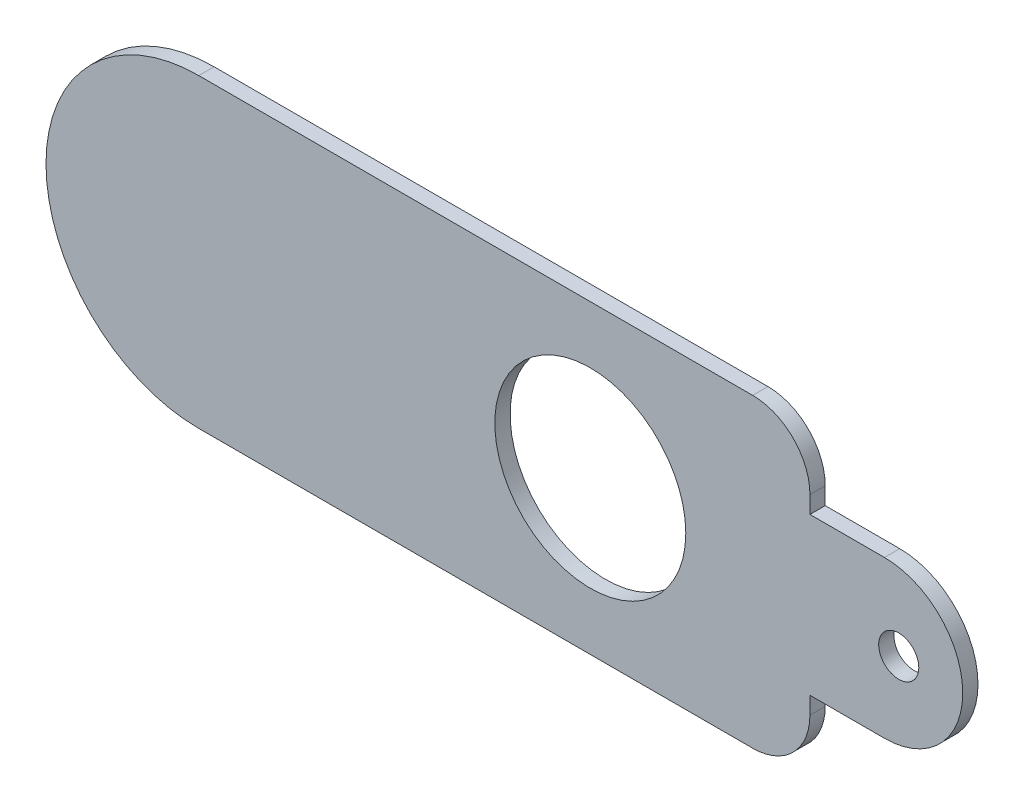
from build123d import *

# Parameters (mm, degrees)
ESQUISSE3_R        = 5
ESQUISSE3_R_2      = 1.05
BOSS_EXTRU_3_DEPTH = 0.8


with BuildPart() as part:
    # Esquisse3 → Boss.-Extru.3 (new body)
    with BuildSketch(Plane.XY):
        with BuildLine():
            Line((-20.5, 8), (8.5, 8))
            ThreePointArc((8.5, 8), (10.621320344, 7.121320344), (11.5, 5))
            Line((11.5, 5), (11.5, 4.1))
            Line((11.5, 4.1), (15.4, 4.1))
            ThreePointArc((15.4, 4.1), (19.5, 0), (15.4, -4.1))
            Line((15.4, -4.1), (11.5, -4.1))
            Line((11.5, -4.1), (11.5, -5))
            ThreePointArc((11.5, -5), (10.621320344, -7.121320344), (8.5, -8))
            Line((8.5, -8), (-20.5, -8))
            ThreePointArc((-20.5, -8), (-28.5, 0), (-20.5, 8))
        make_face()
        Circle(ESQUISSE3_R, mode=Mode.SUBTRACT)
        with Locations((16.15, 0)):
            Circle(ESQUISSE3_R_2, mode=Mode.SUBTRACT)
    extrude(amount=BOSS_EXTRU_3_DEPTH)


solid = part.part
